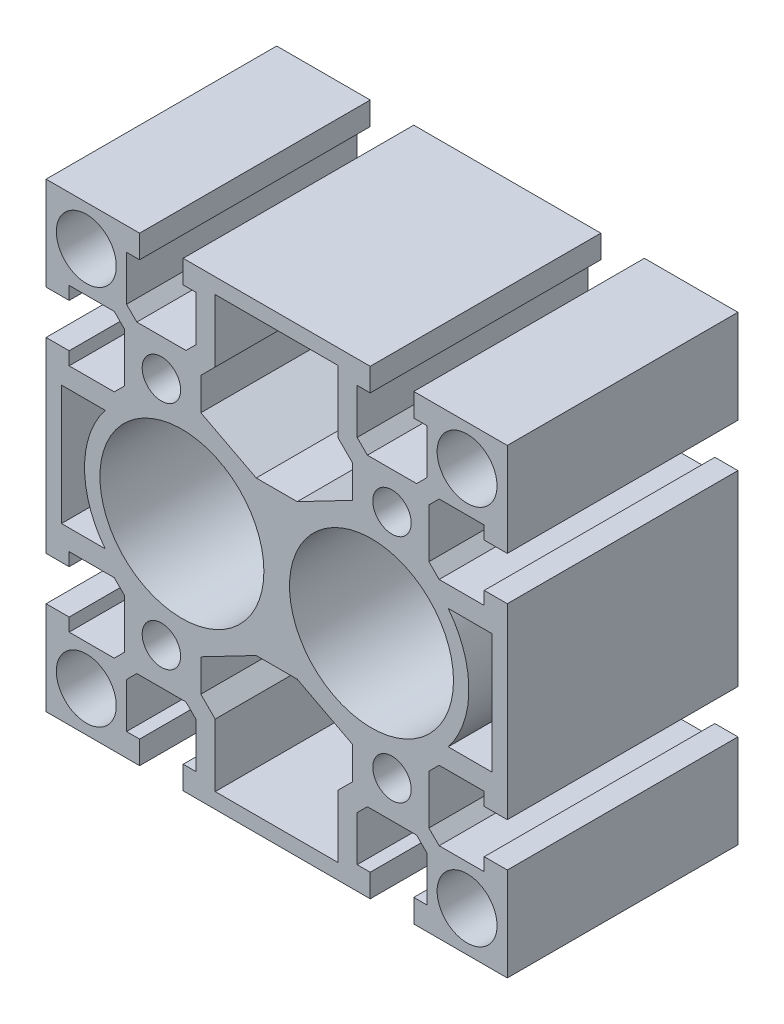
from build123d import *

# Parameters (mm, degrees)
SKETCH1_R                      = 5.8499883
SKETCH1_R_2                    = 3.7499925
SKETCH1_R_3                    = 15.999968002
SKETCH1_R_4                    = 15.999967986
EXTRUDE1_DEPTH                 = 45
F_15_0_15_DIAMETER_HOLE1_D     = 8.2
F_15_0_15_DIAMETER_HOLE1_DEPTH = 38.1
F_15_0_15_DIAMETER_HOLE1_TIP   = 2.463528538


with BuildPart() as part:
    # Sketch1 → Extrude1 (new body)
    with BuildSketch(Plane.XY):
        Polygon((-44.999909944, -18.249964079), (-40.499918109, -18.249964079), (-40.499918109, -15.699981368), (-31.699947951, -15.699981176), (-29.699952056, -17.699976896), (-29.699951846, -27.299964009), (-31.699947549, -29.299959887), (-40.49991812, -29.299960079), (-40.49991812, -26.749946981), (-44.999910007, -26.749946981), (-44.999910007, -44.999910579), (-26.749946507, -44.999910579), (-26.749946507, -40.499918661), (-29.299959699, -40.499918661), (-29.299959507, -31.699948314), (-27.299963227, -29.699952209), (-17.699976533, -29.699952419), (-15.699980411, -31.699948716), (-15.699980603, -40.499918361), (-18.249963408, -40.499918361), (-18.249963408, -44.999910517), (18.249963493, -44.999910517), (18.249963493, -40.499918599), (15.699950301, -40.499918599), (15.699950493, -31.699948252), (17.699946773, -29.699952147), (27.299933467, -29.699952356), (29.299929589, -31.699948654), (29.299929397, -40.499918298), (26.749946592, -40.499918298), (26.749946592, -44.999910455), (44.999909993, -44.999910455), (44.999909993, -26.749946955), (40.499918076, -26.749946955), (40.499918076, -29.299960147), (31.699947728, -29.299959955), (29.699951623, -27.299963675), (29.699951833, -17.699976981), (31.69994813, -15.699980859), (40.499917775, -15.699981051), (40.499917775, -18.249963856), (44.999909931, -18.249963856), (44.999909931, 18.249963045), (40.499918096, 18.249963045), (40.499918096, 15.699980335), (31.699947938, 15.699980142), (29.699952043, 17.699975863), (29.699951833, 27.299962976), (31.699947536, 29.299958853), (40.499918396, 29.299959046), (40.499918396, 26.749945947), (44.999909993, 26.749945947), (44.999909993, 44.999909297), (26.749946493, 44.999909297), (26.749946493, 40.499917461), (29.299929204, 40.499917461), (29.299929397, 31.699947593), (27.299933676, 29.699951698), (17.699946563, 29.699951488), (15.699950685, 31.699947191), (15.699950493, 40.499917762), (18.249963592, 40.499917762), (18.249963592, 44.999909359), (-18.249963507, 44.999909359), (-18.249963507, 40.499917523), (-15.699980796, 40.499917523), (-15.699980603, 31.699947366), (-17.699976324, 29.69995147), (-27.299963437, 29.699951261), (-29.299959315, 31.699946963), (-29.299959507, 40.499917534), (-26.749946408, 40.499917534), (-26.749946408, 44.999909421), (-44.999910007, 44.999909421), (-44.999910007, 26.749945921), (-40.499918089, 26.749945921), (-40.499918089, 29.299959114), (-31.699947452, 29.299958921), (-29.699951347, 27.299962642), (-29.699951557, 17.699975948), (-31.699947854, 15.699979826), (-40.499917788, 15.699980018), (-40.499917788, 18.249962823), (-44.999909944, 18.249962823), align=None)
        with Locations(Location((-37.149925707, -37.14992599, 0), (0, 0, 180))):
            Circle(SKETCH1_R, mode=Mode.SUBTRACT)
        with Locations(Location((-22.499955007, -22.49995529, 0), (0, 0, 180))):
            Circle(SKETCH1_R_2, mode=Mode.SUBTRACT)
        with Locations(Location((22.499954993, -22.49995529, 0), (0, 0, 180))):
            Circle(SKETCH1_R_2, mode=Mode.SUBTRACT)
        with Locations(Location((37.149925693, -37.14992599, 0), (0, 0, 180))):
            Circle(SKETCH1_R, mode=Mode.SUBTRACT)
        with Locations(Location((37.149925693, 37.14992541, 0), (0, 0, 180))):
            Circle(SKETCH1_R, mode=Mode.SUBTRACT)
        with Locations(Location((22.499954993, 22.49995471, 0), (0, 0, 180))):
            Circle(SKETCH1_R_2, mode=Mode.SUBTRACT)
        with Locations(Location((-22.499955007, 22.49995471, 0), (0, 0, 180))):
            Circle(SKETCH1_R_2, mode=Mode.SUBTRACT)
        with Locations(Location((-37.149925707, 37.14992541, 0), (0, 0, 180))):
            Circle(SKETCH1_R, mode=Mode.SUBTRACT)
        with Locations(Location((18.499962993, -2.95e-07, 0), (0, 0, 180))):
            Circle(SKETCH1_R_3, mode=Mode.SUBTRACT)
        with Locations(Location((-18.499962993, -2.83e-07, 0), (0, 0, 180))):
            Circle(SKETCH1_R_4, mode=Mode.SUBTRACT)
        with BuildLine():
            Line((41.999915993, 11.699976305), (41.999915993, -11.699976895))
            Line((41.999915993, -11.699976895), (33.470236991, -11.699976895))
            ThreePointArc((33.470236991, -11.699976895), (37.499924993, -2.95e-07), (33.470236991, 11.699976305))
            Line((33.470236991, 11.699976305), (41.999915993, 11.699976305))
        make_face(mode=Mode.SUBTRACT)
        Polygon((14.799970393, -26.943086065), (11.999975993, -29.74308022), (11.999975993, -41.999916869), (-11.999976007, -41.999916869), (-11.999976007, -29.743110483), (-14.799970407, -26.943115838), (-14.799970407, -20.620887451), (-3.999992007, -14.999970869), (3.999991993, -14.999970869), (14.799970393, -20.620887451), align=None, mode=Mode.SUBTRACT)
        with BuildLine():
            Line((-33.470236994, -11.699976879), (-41.999915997, -11.699976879))
            Line((-41.999915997, -11.699976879), (-41.999915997, 11.699976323))
            Line((-41.999915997, 11.699976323), (-33.470236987, 11.699976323))
            ThreePointArc((-33.470236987, 11.699976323), (-37.499924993, -2.77e-07), (-33.470236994, -11.699976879))
        make_face(mode=Mode.SUBTRACT)
        Polygon((11.999975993, 41.99991571), (11.999975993, 29.743079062), (14.799970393, 26.943084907), (14.799970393, 20.620886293), (3.999991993, 14.99996971), (-3.999992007, 14.99996971), (-14.799970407, 20.620886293), (-14.799970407, 26.94311468), (-11.999976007, 29.743109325), (-11.999976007, 41.99991571), align=None, mode=Mode.SUBTRACT)
    extrude(amount=EXTRUDE1_DEPTH)

    # 15.0 _15_ Diameter Hole1
    with Locations(Plane(origin=(-22.499910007, 44.999909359, 22.5), x_dir=(0, 0, 1), z_dir=(0, 1, 0))):
        with Locations((0, 0), (0, 44.99982)):
            Hole(F_15_0_15_DIAMETER_HOLE1_D / 2, depth=F_15_0_15_DIAMETER_HOLE1_DEPTH)
            with Locations((0, 0, -(F_15_0_15_DIAMETER_HOLE1_DEPTH + F_15_0_15_DIAMETER_HOLE1_TIP / 2))):  # 118° drill point
                Cone(0, F_15_0_15_DIAMETER_HOLE1_D / 2, F_15_0_15_DIAMETER_HOLE1_TIP, mode=Mode.SUBTRACT)


solid = part.part
